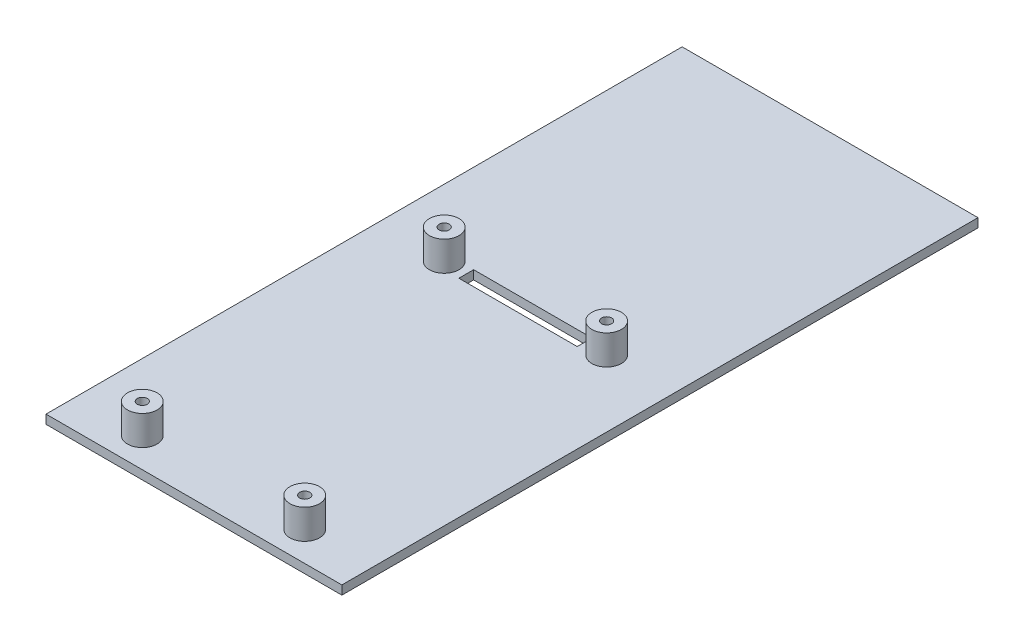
from build123d import *

# Parameters (mm, degrees)
SCHIZZO18_W                  = 100
SCHIZZO18_H                  = 215
ESTRUSIONE_ESTRUSIONE6_DEPTH = 3
SCHIZZO22_R                  = 5
ESTRUSIONE_ESTRUSIONE7_DEPTH = 10
FORO_PER_VITE_M3_1_D         = 3.4
SCHIZZO27_W                  = 40
SCHIZZO27_H                  = 5
TAGLIO_ESTRUSIONE1_DEPTH     = 119.980040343


with BuildPart() as part:
    # Schizzo18 → Estrusione-Estrusione6 (new body)
    with BuildSketch(Plane(origin=(0, 0, 0), x_dir=(1, 0, 0), z_dir=(0, 1, 0))):
        Rectangle(SCHIZZO18_W, SCHIZZO18_H)
    extrude(amount=ESTRUSIONE_ESTRUSIONE6_DEPTH)

    # Schizzo22 → Estrusione-Estrusione7 (add)
    with BuildSketch(Plane(origin=(0, 3, 0), x_dir=(1, 0, 0), z_dir=(0, 1, 0))):
        with Locations(Location((-27.45, 4.54, 0), (0, 0, 270))):
            Circle(SCHIZZO22_R)
        with Locations(Location((-27.45, -97.5, 0), (0, 0, 270))):
            Circle(SCHIZZO22_R)
        with Locations(Location((27.45, 4.54, 0), (0, 0, 270))):
            Circle(SCHIZZO22_R)
        with Locations(Location((27.45, -97.5, 0), (0, 0, 270))):
            Circle(SCHIZZO22_R)
    extrude(amount=ESTRUSIONE_ESTRUSIONE7_DEPTH)

    # Foro per Vite M3-1 (through all)
    with Locations(Plane(origin=(0, 13, 0), x_dir=(1, 0, 0), z_dir=(0, 1, 0))):
        with Locations((-27.45, 4.54), (-27.45, -97.5), (27.45, -97.5), (27.45, 4.54)):
            Hole(FORO_PER_VITE_M3_1_D / 2)

    # Schizzo27 → Taglio-Estrusione1 (cut, through all)
    with BuildSketch(Plane(origin=(0, 3, 0), x_dir=(1, 0, 0), z_dir=(0, 1, 0))):
        with Locations((0, 4.54)):
            Rectangle(SCHIZZO27_W, SCHIZZO27_H)
    extrude(amount=-TAGLIO_ESTRUSIONE1_DEPTH, mode=Mode.SUBTRACT)


solid = part.part
